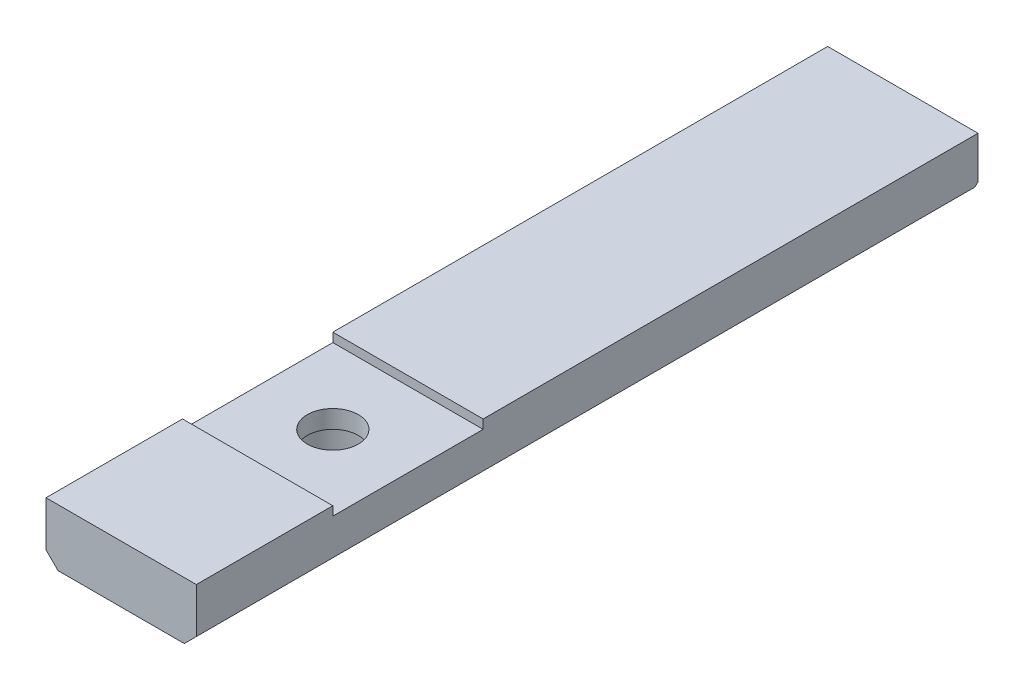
ISO-10303-21;
HEADER;
FILE_DESCRIPTION(('STEP AP214'),'2;1');
FILE_NAME('part.step','',(''),(''),'','','');
FILE_SCHEMA(('AUTOMOTIVE_DESIGN { 1 0 10303 214 1 1 1 1 }'));
ENDSEC;
DATA;
#1=APPLICATION_CONTEXT('core data for automotive mechanical design processes');
#2=APPLICATION_PROTOCOL_DEFINITION('international standard','automotive_design',2000,#1);
#3=PRODUCT_CONTEXT('',#1,'mechanical');
#4=PRODUCT('Part','Part','',(#3));
#5=PRODUCT_RELATED_PRODUCT_CATEGORY('part','',(#4));
#6=PRODUCT_DEFINITION_FORMATION('','',#4);
#7=PRODUCT_DEFINITION_CONTEXT('part definition',#1,'design');
#8=PRODUCT_DEFINITION('design','',#6,#7);
#9=PRODUCT_DEFINITION_SHAPE('','',#8);
#10=(LENGTH_UNIT() NAMED_UNIT(*) SI_UNIT(.MILLI.,.METRE.));
#11=(NAMED_UNIT(*) PLANE_ANGLE_UNIT() SI_UNIT($,.RADIAN.));
#12=(NAMED_UNIT(*) SI_UNIT($,.STERADIAN.) SOLID_ANGLE_UNIT());
#13=UNCERTAINTY_MEASURE_WITH_UNIT(LENGTH_MEASURE(1.E-05),#10,'distance_accuracy_value','');
#14=(GEOMETRIC_REPRESENTATION_CONTEXT(3) GLOBAL_UNCERTAINTY_ASSIGNED_CONTEXT((#13)) GLOBAL_UNIT_ASSIGNED_CONTEXT((#10,
#11,#12)) REPRESENTATION_CONTEXT('',''));
#15=CARTESIAN_POINT('',(0.,0.,0.));
#16=DIRECTION('',(0.,0.,1.));
#17=DIRECTION('',(1.,0.,0.));
#18=AXIS2_PLACEMENT_3D('',#15,#16,#17);
#19=CARTESIAN_POINT('',(-6.1,0.,130.));
#20=DIRECTION('',(-1.,0.,0.));
#21=DIRECTION('',(0.,0.,1.));
#22=AXIS2_PLACEMENT_3D('',#19,#20,#21);
#23=PLANE('',#22);
#24=DIRECTION('',(0.,0.,-1.));
#25=VECTOR('',#24,1.);
#26=CARTESIAN_POINT('',(-6.1,1.5,130.));
#27=LINE('',#26,#25);
#28=CARTESIAN_POINT('',(-6.1,1.5,91.3663430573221));
#29=VERTEX_POINT('',#28);
#30=CARTESIAN_POINT('',(-6.1,1.5,3.));
#31=VERTEX_POINT('',#30);
#32=EDGE_CURVE('E363',#29,#31,#27,.T.);
#33=ORIENTED_EDGE('',*,*,#32,.F.);
#34=DIRECTION('',(0.,-1.,0.));
#35=VECTOR('',#34,1.);
#36=CARTESIAN_POINT('',(-6.1,7.,91.3663430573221));
#37=LINE('',#36,#35);
#38=CARTESIAN_POINT('',(-6.1,0.500000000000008,91.3663430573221));
#39=VERTEX_POINT('',#38);
#40=EDGE_CURVE('E376',#29,#39,#37,.T.);
#41=ORIENTED_EDGE('',*,*,#40,.T.);
#42=DIRECTION('',(0.,0.,-1.));
#43=VECTOR('',#42,1.);
#44=CARTESIAN_POINT('',(-6.1,0.500000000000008,130.));
#45=LINE('',#44,#43);
#46=CARTESIAN_POINT('',(-6.1,0.500000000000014,3.99999999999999));
#47=VERTEX_POINT('',#46);
#48=EDGE_CURVE('E366',#39,#47,#45,.T.);
#49=ORIENTED_EDGE('',*,*,#48,.T.);
#50=DIRECTION('',(0.,0.707106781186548,-0.707106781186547));
#51=VECTOR('',#50,1.);
#52=CARTESIAN_POINT('',(-6.1,-62.75,67.25));
#53=LINE('',#52,#51);
#54=EDGE_CURVE('E296',#47,#31,#53,.T.);
#55=ORIENTED_EDGE('',*,*,#54,.T.);
#56=EDGE_LOOP('',(#33,#41,#49,#55));
#57=FACE_BOUND('',#56,.T.);
#58=ADVANCED_FACE('F40',(#57),#23,.F.);
#59=CARTESIAN_POINT('',(-6.1,1.5,130.));
#60=DIRECTION('',(0.,1.,0.));
#61=DIRECTION('',(-1.,0.,0.));
#62=AXIS2_PLACEMENT_3D('',#59,#60,#61);
#63=PLANE('',#62);
#64=CARTESIAN_POINT('',(-6.1,1.5,129.5));
#65=VERTEX_POINT('',#64);
#66=CARTESIAN_POINT('',(-6.1,1.5,98.2336569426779));
#67=VERTEX_POINT('',#66);
#68=EDGE_CURVE('E364',#65,#67,#27,.T.);
#69=ORIENTED_EDGE('',*,*,#68,.T.);
#70=CARTESIAN_POINT('',(0.,1.5,94.8));
#71=DIRECTION('',(0.,1.,0.));
#72=DIRECTION('',(-1.,0.,0.));
#73=AXIS2_PLACEMENT_3D('',#70,#71,#72);
#74=CIRCLE('',#73,7.00000000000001);
#75=CARTESIAN_POINT('',(6.1,1.5,98.2336569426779));
#76=VERTEX_POINT('',#75);
#77=EDGE_CURVE('E400',#67,#76,#74,.T.);
#78=ORIENTED_EDGE('',*,*,#77,.T.);
#79=DIRECTION('',(0.,0.,-1.));
#80=VECTOR('',#79,1.);
#81=CARTESIAN_POINT('',(6.1,1.5,130.));
#82=LINE('',#81,#80);
#83=CARTESIAN_POINT('',(6.1,1.5,129.5));
#84=VERTEX_POINT('',#83);
#85=EDGE_CURVE('E360',#84,#76,#82,.T.);
#86=ORIENTED_EDGE('',*,*,#85,.F.);
#87=DIRECTION('',(-1.,0.,0.));
#88=VECTOR('',#87,1.);
#89=CARTESIAN_POINT('',(-6.1,1.5,129.5));
#90=LINE('',#89,#88);
#91=EDGE_CURVE('E303',#84,#65,#90,.T.);
#92=ORIENTED_EDGE('',*,*,#91,.T.);
#93=EDGE_LOOP('',(#69,#78,#86,#92));
#94=FACE_BOUND('',#93,.T.);
#95=ADVANCED_FACE('F398',(#94),#63,.F.);
#96=CARTESIAN_POINT('',(6.1,1.5,130.));
#97=DIRECTION('',(1.,0.,0.));
#98=DIRECTION('',(0.,0.,-1.));
#99=AXIS2_PLACEMENT_3D('',#96,#97,#98);
#100=PLANE('',#99);
#101=ORIENTED_EDGE('',*,*,#85,.T.);
#102=DIRECTION('',(0.,-1.,0.));
#103=VECTOR('',#102,1.);
#104=CARTESIAN_POINT('',(6.1,7.,98.2336569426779));
#105=LINE('',#104,#103);
#106=CARTESIAN_POINT('',(6.1,0.500000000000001,98.2336569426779));
#107=VERTEX_POINT('',#106);
#108=EDGE_CURVE('E407',#76,#107,#105,.T.);
#109=ORIENTED_EDGE('',*,*,#108,.T.);
#110=DIRECTION('',(0.,0.,1.));
#111=VECTOR('',#110,1.);
#112=CARTESIAN_POINT('',(6.1,0.500000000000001,130.));
#113=LINE('',#112,#111);
#114=CARTESIAN_POINT('',(6.1,0.500000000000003,128.5));
#115=VERTEX_POINT('',#114);
#116=EDGE_CURVE('E232',#107,#115,#113,.T.);
#117=ORIENTED_EDGE('',*,*,#116,.T.);
#118=DIRECTION('',(0.,0.707106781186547,0.707106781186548));
#119=VECTOR('',#118,1.);
#120=CARTESIAN_POINT('',(6.1,1.75,129.75));
#121=LINE('',#120,#119);
#122=EDGE_CURVE('E300',#115,#84,#121,.T.);
#123=ORIENTED_EDGE('',*,*,#122,.T.);
#124=EDGE_LOOP('',(#101,#109,#117,#123));
#125=FACE_BOUND('',#124,.T.);
#126=ADVANCED_FACE('F404',(#125),#100,.F.);
#127=CARTESIAN_POINT('',(-6.1,0.500000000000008,130.));
#128=DIRECTION('',(-0.707106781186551,0.707106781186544,0.));
#129=DIRECTION('',(-0.707106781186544,-0.707106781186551,0.));
#130=AXIS2_PLACEMENT_3D('',#127,#128,#129);
#131=PLANE('',#130);
#132=CARTESIAN_POINT('',(0.,6.60000000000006,94.8));
#133=DIRECTION('',(-0.707106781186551,0.707106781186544,0.));
#134=DIRECTION('',(-0.707106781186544,-0.707106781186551,0.));
#135=AXIS2_PLACEMENT_3D('',#132,#133,#134);
#136=ELLIPSE('',#135,9.89949493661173,7.00000000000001);
#137=CARTESIAN_POINT('',(-6.6,0.,92.4676192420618));
#138=VERTEX_POINT('',#137);
#139=EDGE_CURVE('E382',#138,#39,#136,.F.);
#140=ORIENTED_EDGE('',*,*,#139,.F.);
#141=DIRECTION('',(0.,0.,1.));
#142=VECTOR('',#141,1.);
#143=CARTESIAN_POINT('',(-6.6,0.,130.));
#144=LINE('',#143,#142);
#145=CARTESIAN_POINT('',(-6.6,0.,4.49999999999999));
#146=VERTEX_POINT('',#145);
#147=EDGE_CURVE('E230',#146,#138,#144,.T.);
#148=ORIENTED_EDGE('',*,*,#147,.F.);
#149=DIRECTION('',(0.577350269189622,0.577350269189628,-0.577350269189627));
#150=VECTOR('',#149,1.);
#151=CARTESIAN_POINT('',(-48.0999999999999,-41.5000000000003,46.0000000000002));
#152=LINE('',#151,#150);
#153=EDGE_CURVE('E275',#47,#146,#152,.F.);
#154=ORIENTED_EDGE('',*,*,#153,.F.);
#155=ORIENTED_EDGE('',*,*,#48,.F.);
#156=EDGE_LOOP('',(#140,#148,#154,#155));
#157=FACE_BOUND('',#156,.T.);
#158=ADVANCED_FACE('F381',(#157),#131,.F.);
#159=CARTESIAN_POINT('',(6.60000000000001,0.,130.));
#160=DIRECTION('',(0.707106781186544,0.707106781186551,0.));
#161=DIRECTION('',(-0.707106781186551,0.707106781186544,0.));
#162=AXIS2_PLACEMENT_3D('',#159,#160,#161);
#163=PLANE('',#162);
#164=CARTESIAN_POINT('',(0.,6.59999999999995,94.8));
#165=DIRECTION('',(0.707106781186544,0.707106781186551,0.));
#166=DIRECTION('',(0.707106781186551,-0.707106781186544,0.));
#167=AXIS2_PLACEMENT_3D('',#164,#165,#166);
#168=ELLIPSE('',#167,9.89949493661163,7.00000000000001);
#169=CARTESIAN_POINT('',(6.60000000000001,0.,97.1323807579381));
#170=VERTEX_POINT('',#169);
#171=EDGE_CURVE('E213',#170,#107,#168,.F.);
#172=ORIENTED_EDGE('',*,*,#171,.F.);
#173=DIRECTION('',(0.,0.,-1.));
#174=VECTOR('',#173,1.);
#175=CARTESIAN_POINT('',(6.60000000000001,0.,130.));
#176=LINE('',#175,#174);
#177=CARTESIAN_POINT('',(6.6,0.,128.));
#178=VERTEX_POINT('',#177);
#179=EDGE_CURVE('E224',#178,#170,#176,.T.);
#180=ORIENTED_EDGE('',*,*,#179,.F.);
#181=DIRECTION('',(-0.57735026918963,0.577350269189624,0.577350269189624));
#182=VECTOR('',#181,1.);
#183=CARTESIAN_POINT('',(5.93333333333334,0.666666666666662,128.666666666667));
#184=LINE('',#183,#182);
#185=EDGE_CURVE('E214',#115,#178,#184,.F.);
#186=ORIENTED_EDGE('',*,*,#185,.F.);
#187=ORIENTED_EDGE('',*,*,#116,.F.);
#188=EDGE_LOOP('',(#172,#180,#186,#187));
#189=FACE_BOUND('',#188,.T.);
#190=ADVANCED_FACE('F409',(#189),#163,.F.);
#191=CARTESIAN_POINT('',(0.,0.,94.8));
#192=DIRECTION('',(0.,1.,0.));
#193=DIRECTION('',(0.,0.,1.));
#194=AXIS2_PLACEMENT_3D('',#191,#192,#193);
#195=CYLINDRICAL_SURFACE('',#194,4.25000000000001);
#196=CARTESIAN_POINT('',(0.,10.,94.8));
#197=DIRECTION('',(0.,1.,0.));
#198=DIRECTION('',(0.,0.,1.));
#199=AXIS2_PLACEMENT_3D('',#196,#197,#198);
#200=CIRCLE('',#199,4.25000000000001);
#201=CARTESIAN_POINT('',(0.,10.,99.05));
#202=VERTEX_POINT('',#201);
#203=EDGE_CURVE('E423',#202,#202,#200,.T.);
#204=ORIENTED_EDGE('',*,*,#203,.T.);
#205=EDGE_LOOP('',(#204));
#206=FACE_BOUND('',#205,.T.);
#207=CARTESIAN_POINT('',(0.,7.,94.8));
#208=DIRECTION('',(0.,-1.,0.));
#209=DIRECTION('',(0.,0.,-1.));
#210=AXIS2_PLACEMENT_3D('',#207,#208,#209);
#211=CIRCLE('',#210,4.25000000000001);
#212=CARTESIAN_POINT('',(0.,7.,90.55));
#213=VERTEX_POINT('',#212);
#214=EDGE_CURVE('E225',#213,#213,#211,.F.);
#215=ORIENTED_EDGE('',*,*,#214,.F.);
#216=EDGE_LOOP('',(#215));
#217=FACE_BOUND('',#216,.T.);
#218=ADVANCED_FACE('F483',(#206,#217),#195,.F.);
#219=CARTESIAN_POINT('',(-12.5,11.5,130.));
#220=DIRECTION('',(0.,-1.,0.));
#221=DIRECTION('',(1.,0.,0.));
#222=AXIS2_PLACEMENT_3D('',#219,#220,#221);
#223=PLANE('',#222);
#224=DIRECTION('',(0.,0.,-1.));
#225=VECTOR('',#224,1.);
#226=CARTESIAN_POINT('',(12.5,11.5,130.));
#227=LINE('',#226,#225);
#228=CARTESIAN_POINT('',(12.5,11.5,130.));
#229=VERTEX_POINT('',#228);
#230=CARTESIAN_POINT('',(12.5,11.5,107.3));
#231=VERTEX_POINT('',#230);
#232=EDGE_CURVE('E356',#229,#231,#227,.T.);
#233=ORIENTED_EDGE('',*,*,#232,.T.);
#234=DIRECTION('',(1.,0.,0.));
#235=VECTOR('',#234,1.);
#236=CARTESIAN_POINT('',(-12.5,11.5,107.3));
#237=LINE('',#236,#235);
#238=CARTESIAN_POINT('',(-12.5,11.5,107.3));
#239=VERTEX_POINT('',#238);
#240=EDGE_CURVE('E329',#239,#231,#237,.T.);
#241=ORIENTED_EDGE('',*,*,#240,.F.);
#242=DIRECTION('',(0.,0.,-1.));
#243=VECTOR('',#242,1.);
#244=CARTESIAN_POINT('',(-12.5,11.5,130.));
#245=LINE('',#244,#243);
#246=CARTESIAN_POINT('',(-12.5,11.5,130.));
#247=VERTEX_POINT('',#246);
#248=EDGE_CURVE('E352',#247,#239,#245,.T.);
#249=ORIENTED_EDGE('',*,*,#248,.F.);
#250=DIRECTION('',(-1.,0.,0.));
#251=VECTOR('',#250,1.);
#252=CARTESIAN_POINT('',(-12.5,11.5,130.));
#253=LINE('',#252,#251);
#254=EDGE_CURVE('E343',#229,#247,#253,.T.);
#255=ORIENTED_EDGE('',*,*,#254,.F.);
#256=EDGE_LOOP('',(#233,#241,#249,#255));
#257=FACE_BOUND('',#256,.T.);
#258=ADVANCED_FACE('F468',(#257),#223,.F.);
#259=CARTESIAN_POINT('',(-12.5,0.,130.));
#260=DIRECTION('',(1.,0.,0.));
#261=DIRECTION('',(0.,1.,0.));
#262=AXIS2_PLACEMENT_3D('',#259,#260,#261);
#263=PLANE('',#262);
#264=DIRECTION('',(0.,-0.707106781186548,0.707106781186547));
#265=VECTOR('',#264,1.);
#266=CARTESIAN_POINT('',(-12.5,4.5,0.));
#267=LINE('',#266,#265);
#268=CARTESIAN_POINT('',(-12.5,4.5,0.));
#269=VERTEX_POINT('',#268);
#270=CARTESIAN_POINT('',(-12.5,4.,0.499999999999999));
#271=VERTEX_POINT('',#270);
#272=EDGE_CURVE('E288',#269,#271,#267,.T.);
#273=ORIENTED_EDGE('',*,*,#272,.T.);
#274=DIRECTION('',(0.,0.,1.));
#275=VECTOR('',#274,1.);
#276=CARTESIAN_POINT('',(-12.5,4.,130.));
#277=LINE('',#276,#275);
#278=CARTESIAN_POINT('',(-12.5,4.,130.));
#279=VERTEX_POINT('',#278);
#280=EDGE_CURVE('E11',#271,#279,#277,.T.);
#281=ORIENTED_EDGE('',*,*,#280,.T.);
#282=DIRECTION('',(0.,-1.,0.));
#283=VECTOR('',#282,1.);
#284=CARTESIAN_POINT('',(-12.5,0.,130.));
#285=LINE('',#284,#283);
#286=EDGE_CURVE('E338',#247,#279,#285,.T.);
#287=ORIENTED_EDGE('',*,*,#286,.F.);
#288=ORIENTED_EDGE('',*,*,#248,.T.);
#289=DIRECTION('',(0.,-1.,0.));
#290=VECTOR('',#289,1.);
#291=CARTESIAN_POINT('',(-12.5,11.5,107.3));
#292=LINE('',#291,#290);
#293=CARTESIAN_POINT('',(-12.5,10.,107.3));
#294=VERTEX_POINT('',#293);
#295=EDGE_CURVE('E312',#239,#294,#292,.T.);
#296=ORIENTED_EDGE('',*,*,#295,.T.);
#297=DIRECTION('',(0.,0.,-1.));
#298=VECTOR('',#297,1.);
#299=CARTESIAN_POINT('',(-12.5,10.,107.3));
#300=LINE('',#299,#298);
#301=CARTESIAN_POINT('',(-12.5,10.,82.3));
#302=VERTEX_POINT('',#301);
#303=EDGE_CURVE('E315',#294,#302,#300,.T.);
#304=ORIENTED_EDGE('',*,*,#303,.T.);
#305=DIRECTION('',(0.,1.,0.));
#306=VECTOR('',#305,1.);
#307=CARTESIAN_POINT('',(-12.5,10.,82.3));
#308=LINE('',#307,#306);
#309=CARTESIAN_POINT('',(-12.5,11.5,82.3));
#310=VERTEX_POINT('',#309);
#311=EDGE_CURVE('E319',#302,#310,#308,.T.);
#312=ORIENTED_EDGE('',*,*,#311,.T.);
#313=CARTESIAN_POINT('',(-12.5,11.5,0.));
#314=VERTEX_POINT('',#313);
#315=EDGE_CURVE('E345',#310,#314,#245,.T.);
#316=ORIENTED_EDGE('',*,*,#315,.T.);
#317=DIRECTION('',(0.,-1.,0.));
#318=VECTOR('',#317,1.);
#319=CARTESIAN_POINT('',(-12.5,0.,0.));
#320=LINE('',#319,#318);
#321=EDGE_CURVE('E331',#314,#269,#320,.T.);
#322=ORIENTED_EDGE('',*,*,#321,.T.);
#323=EDGE_LOOP('',(#273,#281,#287,#288,#296,#304,#312,#316,#322));
#324=FACE_BOUND('',#323,.T.);
#325=ADVANCED_FACE('F464',(#324),#263,.F.);
#326=CARTESIAN_POINT('',(-12.5,0.,130.));
#327=DIRECTION('',(0.,1.,0.));
#328=DIRECTION('',(0.,0.,1.));
#329=AXIS2_PLACEMENT_3D('',#326,#327,#328);
#330=PLANE('',#329);
#331=DIRECTION('',(1.,0.,0.));
#332=VECTOR('',#331,1.);
#333=CARTESIAN_POINT('',(-12.5,0.,128.));
#334=LINE('',#333,#332);
#335=CARTESIAN_POINT('',(-8.5,0.,128.));
#336=VERTEX_POINT('',#335);
#337=CARTESIAN_POINT('',(-6.6,0.,128.));
#338=VERTEX_POINT('',#337);
#339=EDGE_CURVE('E268',#336,#338,#334,.T.);
#340=ORIENTED_EDGE('',*,*,#339,.F.);
#341=DIRECTION('',(0.,0.,-1.));
#342=VECTOR('',#341,1.);
#343=CARTESIAN_POINT('',(-8.5,0.,130.));
#344=LINE('',#343,#342);
#345=CARTESIAN_POINT('',(-8.5,0.,4.5));
#346=VERTEX_POINT('',#345);
#347=EDGE_CURVE('E48',#336,#346,#344,.T.);
#348=ORIENTED_EDGE('',*,*,#347,.T.);
#349=DIRECTION('',(1.,0.,0.));
#350=VECTOR('',#349,1.);
#351=CARTESIAN_POINT('',(-12.5,0.,4.5));
#352=LINE('',#351,#350);
#353=EDGE_CURVE('E265',#346,#146,#352,.T.);
#354=ORIENTED_EDGE('',*,*,#353,.T.);
#355=ORIENTED_EDGE('',*,*,#147,.T.);
#356=CARTESIAN_POINT('',(0.,0.,94.8));
#357=DIRECTION('',(0.,1.,0.));
#358=DIRECTION('',(0.,0.,1.));
#359=AXIS2_PLACEMENT_3D('',#356,#357,#358);
#360=CIRCLE('',#359,7.00000000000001);
#361=CARTESIAN_POINT('',(-6.6,0.,97.1323807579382));
#362=VERTEX_POINT('',#361);
#363=EDGE_CURVE('E384',#138,#362,#360,.T.);
#364=ORIENTED_EDGE('',*,*,#363,.T.);
#365=EDGE_CURVE('E234',#362,#338,#144,.T.);
#366=ORIENTED_EDGE('',*,*,#365,.T.);
#367=EDGE_LOOP('',(#340,#348,#354,#355,#364,#366));
#368=FACE_BOUND('',#367,.T.);
#369=ADVANCED_FACE('F264',(#368),#330,.F.);
#370=CARTESIAN_POINT('',(-6.1,0.500000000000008,128.5));
#371=VERTEX_POINT('',#370);
#372=CARTESIAN_POINT('',(-6.1,0.500000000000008,98.2336569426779));
#373=VERTEX_POINT('',#372);
#374=EDGE_CURVE('E367',#371,#373,#45,.T.);
#375=ORIENTED_EDGE('',*,*,#374,.T.);
#376=DIRECTION('',(0.,-1.,0.));
#377=VECTOR('',#376,1.);
#378=CARTESIAN_POINT('',(-6.1,7.,98.2336569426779));
#379=LINE('',#378,#377);
#380=EDGE_CURVE('E388',#373,#67,#379,.F.);
#381=ORIENTED_EDGE('',*,*,#380,.T.);
#382=ORIENTED_EDGE('',*,*,#68,.F.);
#383=DIRECTION('',(0.,-0.707106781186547,-0.707106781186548));
#384=VECTOR('',#383,1.);
#385=CARTESIAN_POINT('',(-6.1,1.,129.));
#386=LINE('',#385,#384);
#387=EDGE_CURVE('E306',#65,#371,#386,.T.);
#388=ORIENTED_EDGE('',*,*,#387,.T.);
#389=EDGE_LOOP('',(#375,#381,#382,#388));
#390=FACE_BOUND('',#389,.T.);
#391=ADVANCED_FACE('F395',(#390),#23,.F.);
#392=CARTESIAN_POINT('',(6.1,1.5,91.3663430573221));
#393=VERTEX_POINT('',#392);
#394=CARTESIAN_POINT('',(6.1,1.5,3.));
#395=VERTEX_POINT('',#394);
#396=EDGE_CURVE('E359',#393,#395,#82,.T.);
#397=ORIENTED_EDGE('',*,*,#396,.F.);
#398=EDGE_CURVE('E431',#393,#29,#74,.T.);
#399=ORIENTED_EDGE('',*,*,#398,.T.);
#400=ORIENTED_EDGE('',*,*,#32,.T.);
#401=DIRECTION('',(1.,0.,0.));
#402=VECTOR('',#401,1.);
#403=CARTESIAN_POINT('',(-6.10000000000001,1.5,3.));
#404=LINE('',#403,#402);
#405=EDGE_CURVE('E292',#31,#395,#404,.T.);
#406=ORIENTED_EDGE('',*,*,#405,.T.);
#407=EDGE_LOOP('',(#397,#399,#400,#406));
#408=FACE_BOUND('',#407,.T.);
#409=ADVANCED_FACE('F455',(#408),#63,.F.);
#410=CARTESIAN_POINT('',(6.09999999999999,0.500000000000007,3.99999999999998));
#411=VERTEX_POINT('',#410);
#412=CARTESIAN_POINT('',(6.1,0.500000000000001,91.3663430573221));
#413=VERTEX_POINT('',#412);
#414=EDGE_CURVE('E238',#411,#413,#113,.T.);
#415=ORIENTED_EDGE('',*,*,#414,.T.);
#416=DIRECTION('',(0.,-1.,0.));
#417=VECTOR('',#416,1.);
#418=CARTESIAN_POINT('',(6.1,7.,91.3663430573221));
#419=LINE('',#418,#417);
#420=EDGE_CURVE('E208',#413,#393,#419,.F.);
#421=ORIENTED_EDGE('',*,*,#420,.T.);
#422=ORIENTED_EDGE('',*,*,#396,.T.);
#423=DIRECTION('',(0.,-0.707106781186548,0.707106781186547));
#424=VECTOR('',#423,1.);
#425=CARTESIAN_POINT('',(6.1,-62.,66.5));
#426=LINE('',#425,#424);
#427=EDGE_CURVE('E289',#395,#411,#426,.T.);
#428=ORIENTED_EDGE('',*,*,#427,.T.);
#429=EDGE_LOOP('',(#415,#421,#422,#428));
#430=FACE_BOUND('',#429,.T.);
#431=ADVANCED_FACE('F462',(#430),#100,.F.);
#432=CARTESIAN_POINT('',(6.1,0.,130.));
#433=DIRECTION('',(0.,1.,0.));
#434=DIRECTION('',(-1.,0.,0.));
#435=AXIS2_PLACEMENT_3D('',#432,#433,#434);
#436=PLANE('',#435);
#437=CARTESIAN_POINT('',(6.60000000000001,0.,4.49999999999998));
#438=VERTEX_POINT('',#437);
#439=CARTESIAN_POINT('',(8.49999999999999,0.,4.5));
#440=VERTEX_POINT('',#439);
#441=EDGE_CURVE('E278',#438,#440,#352,.T.);
#442=ORIENTED_EDGE('',*,*,#441,.T.);
#443=DIRECTION('',(0.,0.,1.));
#444=VECTOR('',#443,1.);
#445=CARTESIAN_POINT('',(8.49999999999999,0.,130.));
#446=LINE('',#445,#444);
#447=CARTESIAN_POINT('',(8.49999999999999,0.,128.));
#448=VERTEX_POINT('',#447);
#449=EDGE_CURVE('E252',#440,#448,#446,.T.);
#450=ORIENTED_EDGE('',*,*,#449,.T.);
#451=EDGE_CURVE('E277',#178,#448,#334,.T.);
#452=ORIENTED_EDGE('',*,*,#451,.F.);
#453=ORIENTED_EDGE('',*,*,#179,.T.);
#454=CARTESIAN_POINT('',(0.,0.,94.8));
#455=DIRECTION('',(0.,1.,0.));
#456=DIRECTION('',(-1.,0.,0.));
#457=AXIS2_PLACEMENT_3D('',#454,#455,#456);
#458=CIRCLE('',#457,7.00000000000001);
#459=CARTESIAN_POINT('',(6.60000000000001,0.,92.4676192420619));
#460=VERTEX_POINT('',#459);
#461=EDGE_CURVE('E205',#170,#460,#458,.T.);
#462=ORIENTED_EDGE('',*,*,#461,.T.);
#463=EDGE_CURVE('E220',#460,#438,#176,.T.);
#464=ORIENTED_EDGE('',*,*,#463,.T.);
#465=EDGE_LOOP('',(#442,#450,#452,#453,#462,#464));
#466=FACE_BOUND('',#465,.T.);
#467=ADVANCED_FACE('F219',(#466),#436,.F.);
#468=CARTESIAN_POINT('',(12.5,11.5,130.));
#469=DIRECTION('',(-1.,0.,0.));
#470=DIRECTION('',(0.,-1.,0.));
#471=AXIS2_PLACEMENT_3D('',#468,#469,#470);
#472=PLANE('',#471);
#473=DIRECTION('',(0.,1.,0.));
#474=VECTOR('',#473,1.);
#475=CARTESIAN_POINT('',(12.5,11.5,130.));
#476=LINE('',#475,#474);
#477=CARTESIAN_POINT('',(12.5,3.99999999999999,130.));
#478=VERTEX_POINT('',#477);
#479=EDGE_CURVE('E340',#478,#229,#476,.T.);
#480=ORIENTED_EDGE('',*,*,#479,.F.);
#481=DIRECTION('',(0.,0.,-1.));
#482=VECTOR('',#481,1.);
#483=CARTESIAN_POINT('',(12.5,3.99999999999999,130.));
#484=LINE('',#483,#482);
#485=CARTESIAN_POINT('',(12.5,3.99999999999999,0.500000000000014));
#486=VERTEX_POINT('',#485);
#487=EDGE_CURVE('E245',#478,#486,#484,.T.);
#488=ORIENTED_EDGE('',*,*,#487,.T.);
#489=DIRECTION('',(0.,-0.707106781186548,0.707106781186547));
#490=VECTOR('',#489,1.);
#491=CARTESIAN_POINT('',(12.5,4.5,0.));
#492=LINE('',#491,#490);
#493=CARTESIAN_POINT('',(12.5,4.5,0.));
#494=VERTEX_POINT('',#493);
#495=EDGE_CURVE('E285',#494,#486,#492,.T.);
#496=ORIENTED_EDGE('',*,*,#495,.F.);
#497=DIRECTION('',(0.,1.,0.));
#498=VECTOR('',#497,1.);
#499=CARTESIAN_POINT('',(12.5,11.5,0.));
#500=LINE('',#499,#498);
#501=CARTESIAN_POINT('',(12.5,11.5,0.));
#502=VERTEX_POINT('',#501);
#503=EDGE_CURVE('E348',#494,#502,#500,.T.);
#504=ORIENTED_EDGE('',*,*,#503,.T.);
#505=CARTESIAN_POINT('',(12.5,11.5,82.3));
#506=VERTEX_POINT('',#505);
#507=EDGE_CURVE('E355',#506,#502,#227,.T.);
#508=ORIENTED_EDGE('',*,*,#507,.F.);
#509=DIRECTION('',(0.,1.,0.));
#510=VECTOR('',#509,1.);
#511=CARTESIAN_POINT('',(12.5,10.,82.3));
#512=LINE('',#511,#510);
#513=CARTESIAN_POINT('',(12.5,10.,82.3));
#514=VERTEX_POINT('',#513);
#515=EDGE_CURVE('E316',#514,#506,#512,.T.);
#516=ORIENTED_EDGE('',*,*,#515,.F.);
#517=DIRECTION('',(0.,0.,-1.));
#518=VECTOR('',#517,1.);
#519=CARTESIAN_POINT('',(12.5,10.,107.3));
#520=LINE('',#519,#518);
#521=CARTESIAN_POINT('',(12.5,10.,107.3));
#522=VERTEX_POINT('',#521);
#523=EDGE_CURVE('E325',#522,#514,#520,.T.);
#524=ORIENTED_EDGE('',*,*,#523,.F.);
#525=DIRECTION('',(0.,-1.,0.));
#526=VECTOR('',#525,1.);
#527=CARTESIAN_POINT('',(12.5,11.5,107.3));
#528=LINE('',#527,#526);
#529=EDGE_CURVE('E311',#231,#522,#528,.T.);
#530=ORIENTED_EDGE('',*,*,#529,.F.);
#531=ORIENTED_EDGE('',*,*,#232,.F.);
#532=EDGE_LOOP('',(#480,#488,#496,#504,#508,#516,#524,#530,#531));
#533=FACE_BOUND('',#532,.T.);
#534=ADVANCED_FACE('F500',(#533),#472,.F.);
#535=ORIENTED_EDGE('',*,*,#315,.F.);
#536=DIRECTION('',(1.,0.,0.));
#537=VECTOR('',#536,1.);
#538=CARTESIAN_POINT('',(-12.5,11.5,82.3));
#539=LINE('',#538,#537);
#540=EDGE_CURVE('E332',#310,#506,#539,.T.);
#541=ORIENTED_EDGE('',*,*,#540,.T.);
#542=ORIENTED_EDGE('',*,*,#507,.T.);
#543=DIRECTION('',(-1.,0.,0.));
#544=VECTOR('',#543,1.);
#545=CARTESIAN_POINT('',(-12.5,11.5,0.));
#546=LINE('',#545,#544);
#547=EDGE_CURVE('E341',#502,#314,#546,.T.);
#548=ORIENTED_EDGE('',*,*,#547,.T.);
#549=EDGE_LOOP('',(#535,#541,#542,#548));
#550=FACE_BOUND('',#549,.T.);
#551=ADVANCED_FACE('F505',(#550),#223,.F.);
#552=CARTESIAN_POINT('',(-12.5,0.,130.));
#553=DIRECTION('',(0.,0.,-1.));
#554=DIRECTION('',(-1.,0.,0.));
#555=AXIS2_PLACEMENT_3D('',#552,#553,#554);
#556=PLANE('',#555);
#557=DIRECTION('',(1.,0.,0.));
#558=VECTOR('',#557,1.);
#559=CARTESIAN_POINT('',(-12.5,2.,130.));
#560=LINE('',#559,#558);
#561=CARTESIAN_POINT('',(-10.5,2.,130.));
#562=VERTEX_POINT('',#561);
#563=CARTESIAN_POINT('',(10.5,2.,130.));
#564=VERTEX_POINT('',#563);
#565=EDGE_CURVE('E293',#562,#564,#560,.T.);
#566=ORIENTED_EDGE('',*,*,#565,.T.);
#567=DIRECTION('',(-0.70710678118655,-0.707106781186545,0.));
#568=VECTOR('',#567,1.);
#569=CARTESIAN_POINT('',(12.5,3.99999999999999,130.));
#570=LINE('',#569,#568);
#571=EDGE_CURVE('E259',#564,#478,#570,.F.);
#572=ORIENTED_EDGE('',*,*,#571,.T.);
#573=ORIENTED_EDGE('',*,*,#479,.T.);
#574=ORIENTED_EDGE('',*,*,#254,.T.);
#575=ORIENTED_EDGE('',*,*,#286,.T.);
#576=DIRECTION('',(-0.707106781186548,0.707106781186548,0.));
#577=VECTOR('',#576,1.);
#578=CARTESIAN_POINT('',(-8.5,0.,130.));
#579=LINE('',#578,#577);
#580=EDGE_CURVE('E257',#279,#562,#579,.F.);
#581=ORIENTED_EDGE('',*,*,#580,.T.);
#582=EDGE_LOOP('',(#566,#572,#573,#574,#575,#581));
#583=FACE_BOUND('',#582,.T.);
#584=ADVANCED_FACE('F418',(#583),#556,.F.);
#585=CARTESIAN_POINT('',(-12.5,0.,0.));
#586=DIRECTION('',(0.,0.,-1.));
#587=DIRECTION('',(-1.,0.,0.));
#588=AXIS2_PLACEMENT_3D('',#585,#586,#587);
#589=PLANE('',#588);
#590=DIRECTION('',(1.,0.,0.));
#591=VECTOR('',#590,1.);
#592=CARTESIAN_POINT('',(-12.5,4.5,0.));
#593=LINE('',#592,#591);
#594=EDGE_CURVE('E282',#269,#494,#593,.T.);
#595=ORIENTED_EDGE('',*,*,#594,.F.);
#596=ORIENTED_EDGE('',*,*,#321,.F.);
#597=ORIENTED_EDGE('',*,*,#547,.F.);
#598=ORIENTED_EDGE('',*,*,#503,.F.);
#599=EDGE_LOOP('',(#595,#596,#597,#598));
#600=FACE_BOUND('',#599,.T.);
#601=ADVANCED_FACE('F473',(#600),#589,.T.);
#602=EDGE_CURVE('E387',#373,#362,#136,.F.);
#603=ORIENTED_EDGE('',*,*,#602,.F.);
#604=ORIENTED_EDGE('',*,*,#374,.F.);
#605=DIRECTION('',(-0.577350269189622,-0.577350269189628,-0.577350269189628));
#606=VECTOR('',#605,1.);
#607=CARTESIAN_POINT('',(-5.6,1.00000000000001,129.));
#608=LINE('',#607,#606);
#609=EDGE_CURVE('E309',#338,#371,#608,.F.);
#610=ORIENTED_EDGE('',*,*,#609,.F.);
#611=ORIENTED_EDGE('',*,*,#365,.F.);
#612=EDGE_LOOP('',(#603,#604,#610,#611));
#613=FACE_BOUND('',#612,.T.);
#614=ADVANCED_FACE('F392',(#613),#131,.F.);
#615=EDGE_CURVE('E201',#413,#460,#168,.F.);
#616=ORIENTED_EDGE('',*,*,#615,.F.);
#617=ORIENTED_EDGE('',*,*,#414,.F.);
#618=DIRECTION('',(0.57735026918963,-0.577350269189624,0.577350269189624));
#619=VECTOR('',#618,1.);
#620=CARTESIAN_POINT('',(48.4333333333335,-41.8333333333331,46.333333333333));
#621=LINE('',#620,#619);
#622=EDGE_CURVE('E229',#438,#411,#621,.F.);
#623=ORIENTED_EDGE('',*,*,#622,.F.);
#624=ORIENTED_EDGE('',*,*,#463,.F.);
#625=EDGE_LOOP('',(#616,#617,#623,#624));
#626=FACE_BOUND('',#625,.T.);
#627=ADVANCED_FACE('F228',(#626),#163,.F.);
#628=CARTESIAN_POINT('',(-12.5,11.5,107.3));
#629=DIRECTION('',(0.,0.,1.));
#630=DIRECTION('',(1.,0.,0.));
#631=AXIS2_PLACEMENT_3D('',#628,#629,#630);
#632=PLANE('',#631);
#633=ORIENTED_EDGE('',*,*,#529,.T.);
#634=DIRECTION('',(1.,0.,0.));
#635=VECTOR('',#634,1.);
#636=CARTESIAN_POINT('',(-12.5,10.,107.3));
#637=LINE('',#636,#635);
#638=EDGE_CURVE('E322',#294,#522,#637,.T.);
#639=ORIENTED_EDGE('',*,*,#638,.F.);
#640=ORIENTED_EDGE('',*,*,#295,.F.);
#641=ORIENTED_EDGE('',*,*,#240,.T.);
#642=EDGE_LOOP('',(#633,#639,#640,#641));
#643=FACE_BOUND('',#642,.T.);
#644=ADVANCED_FACE('F475',(#643),#632,.F.);
#645=CARTESIAN_POINT('',(-12.5,10.,82.3));
#646=DIRECTION('',(0.,0.,-1.));
#647=DIRECTION('',(-1.,0.,0.));
#648=AXIS2_PLACEMENT_3D('',#645,#646,#647);
#649=PLANE('',#648);
#650=ORIENTED_EDGE('',*,*,#515,.T.);
#651=ORIENTED_EDGE('',*,*,#540,.F.);
#652=ORIENTED_EDGE('',*,*,#311,.F.);
#653=DIRECTION('',(1.,0.,0.));
#654=VECTOR('',#653,1.);
#655=CARTESIAN_POINT('',(-12.5,10.,82.3));
#656=LINE('',#655,#654);
#657=EDGE_CURVE('E335',#302,#514,#656,.T.);
#658=ORIENTED_EDGE('',*,*,#657,.T.);
#659=EDGE_LOOP('',(#650,#651,#652,#658));
#660=FACE_BOUND('',#659,.T.);
#661=ADVANCED_FACE('F479',(#660),#649,.F.);
#662=CARTESIAN_POINT('',(-12.5,10.,107.3));
#663=DIRECTION('',(0.,-1.,0.));
#664=DIRECTION('',(0.,0.,-1.));
#665=AXIS2_PLACEMENT_3D('',#662,#663,#664);
#666=PLANE('',#665);
#667=ORIENTED_EDGE('',*,*,#203,.F.);
#668=EDGE_LOOP('',(#667));
#669=FACE_BOUND('',#668,.T.);
#670=ORIENTED_EDGE('',*,*,#523,.T.);
#671=ORIENTED_EDGE('',*,*,#657,.F.);
#672=ORIENTED_EDGE('',*,*,#303,.F.);
#673=ORIENTED_EDGE('',*,*,#638,.T.);
#674=EDGE_LOOP('',(#670,#671,#672,#673));
#675=FACE_BOUND('',#674,.T.);
#676=ADVANCED_FACE('F517',(#669,#675),#666,.F.);
#677=CARTESIAN_POINT('',(-12.5,4.5,0.));
#678=DIRECTION('',(0.,0.707106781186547,0.707106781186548));
#679=DIRECTION('',(0.,-0.707106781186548,0.707106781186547));
#680=AXIS2_PLACEMENT_3D('',#677,#678,#679);
#681=PLANE('',#680);
#682=ORIENTED_EDGE('',*,*,#495,.T.);
#683=DIRECTION('',(0.577350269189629,0.577350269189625,-0.577350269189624));
#684=VECTOR('',#683,1.);
#685=CARTESIAN_POINT('',(-30.6666666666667,-39.1666666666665,43.6666666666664));
#686=LINE('',#685,#684);
#687=EDGE_CURVE('E250',#486,#440,#686,.F.);
#688=ORIENTED_EDGE('',*,*,#687,.T.);
#689=ORIENTED_EDGE('',*,*,#441,.F.);
#690=ORIENTED_EDGE('',*,*,#622,.T.);
#691=ORIENTED_EDGE('',*,*,#427,.F.);
#692=ORIENTED_EDGE('',*,*,#405,.F.);
#693=ORIENTED_EDGE('',*,*,#54,.F.);
#694=ORIENTED_EDGE('',*,*,#153,.T.);
#695=ORIENTED_EDGE('',*,*,#353,.F.);
#696=DIRECTION('',(0.577350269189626,-0.577350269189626,0.577350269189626));
#697=VECTOR('',#696,1.);
#698=CARTESIAN_POINT('',(33.3333333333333,-41.8333333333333,46.3333333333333));
#699=LINE('',#698,#697);
#700=EDGE_CURVE('E248',#346,#271,#699,.F.);
#701=ORIENTED_EDGE('',*,*,#700,.T.);
#702=ORIENTED_EDGE('',*,*,#272,.F.);
#703=ORIENTED_EDGE('',*,*,#594,.T.);
#704=EDGE_LOOP('',(#682,#688,#689,#690,#691,#692,#693,#694,#695,#701,#702,#703));
#705=FACE_BOUND('',#704,.T.);
#706=ADVANCED_FACE('F272',(#705),#681,.F.);
#707=CARTESIAN_POINT('',(-12.5,2.,130.));
#708=DIRECTION('',(0.,0.707106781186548,-0.707106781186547));
#709=DIRECTION('',(0.,0.707106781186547,0.707106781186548));
#710=AXIS2_PLACEMENT_3D('',#707,#708,#709);
#711=PLANE('',#710);
#712=ORIENTED_EDGE('',*,*,#451,.T.);
#713=DIRECTION('',(-0.577350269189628,-0.577350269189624,-0.577350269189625));
#714=VECTOR('',#713,1.);
#715=CARTESIAN_POINT('',(11.8333333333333,3.33333333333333,131.333333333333));
#716=LINE('',#715,#714);
#717=EDGE_CURVE('E255',#448,#564,#716,.F.);
#718=ORIENTED_EDGE('',*,*,#717,.T.);
#719=ORIENTED_EDGE('',*,*,#565,.F.);
#720=DIRECTION('',(-0.577350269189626,0.577350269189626,0.577350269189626));
#721=VECTOR('',#720,1.);
#722=CARTESIAN_POINT('',(-9.16666666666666,0.666666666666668,128.666666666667));
#723=LINE('',#722,#721);
#724=EDGE_CURVE('E61',#562,#336,#723,.F.);
#725=ORIENTED_EDGE('',*,*,#724,.T.);
#726=ORIENTED_EDGE('',*,*,#339,.T.);
#727=ORIENTED_EDGE('',*,*,#609,.T.);
#728=ORIENTED_EDGE('',*,*,#387,.F.);
#729=ORIENTED_EDGE('',*,*,#91,.F.);
#730=ORIENTED_EDGE('',*,*,#122,.F.);
#731=ORIENTED_EDGE('',*,*,#185,.T.);
#732=EDGE_LOOP('',(#712,#718,#719,#725,#726,#727,#728,#729,#730,#731));
#733=FACE_BOUND('',#732,.T.);
#734=ADVANCED_FACE('F393',(#733),#711,.F.);
#735=CARTESIAN_POINT('',(0.,7.,94.8));
#736=DIRECTION('',(0.,-1.,0.));
#737=DIRECTION('',(0.,0.,-1.));
#738=AXIS2_PLACEMENT_3D('',#735,#736,#737);
#739=PLANE('',#738);
#740=CARTESIAN_POINT('',(0.,7.,94.8));
#741=DIRECTION('',(0.,-1.,0.));
#742=DIRECTION('',(0.,0.,-1.));
#743=AXIS2_PLACEMENT_3D('',#740,#741,#742);
#744=CIRCLE('',#743,7.00000000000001);
#745=CARTESIAN_POINT('',(0.,7.,87.8));
#746=VERTEX_POINT('',#745);
#747=EDGE_CURVE('E243',#746,#746,#744,.T.);
#748=ORIENTED_EDGE('',*,*,#747,.T.);
#749=EDGE_LOOP('',(#748));
#750=FACE_BOUND('',#749,.T.);
#751=ORIENTED_EDGE('',*,*,#214,.T.);
#752=EDGE_LOOP('',(#751));
#753=FACE_BOUND('',#752,.T.);
#754=ADVANCED_FACE('F439',(#750,#753),#739,.T.);
#755=CARTESIAN_POINT('',(0.,7.,94.8));
#756=DIRECTION('',(0.,-1.,0.));
#757=DIRECTION('',(0.,0.,-1.));
#758=AXIS2_PLACEMENT_3D('',#755,#756,#757);
#759=CYLINDRICAL_SURFACE('',#758,7.00000000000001);
#760=ORIENTED_EDGE('',*,*,#602,.T.);
#761=ORIENTED_EDGE('',*,*,#363,.F.);
#762=ORIENTED_EDGE('',*,*,#139,.T.);
#763=ORIENTED_EDGE('',*,*,#40,.F.);
#764=ORIENTED_EDGE('',*,*,#398,.F.);
#765=ORIENTED_EDGE('',*,*,#420,.F.);
#766=ORIENTED_EDGE('',*,*,#615,.T.);
#767=ORIENTED_EDGE('',*,*,#461,.F.);
#768=ORIENTED_EDGE('',*,*,#171,.T.);
#769=ORIENTED_EDGE('',*,*,#108,.F.);
#770=ORIENTED_EDGE('',*,*,#77,.F.);
#771=ORIENTED_EDGE('',*,*,#380,.F.);
#772=EDGE_LOOP('',(#760,#761,#762,#763,#764,#765,#766,#767,#768,#769,#770,#771));
#773=FACE_BOUND('',#772,.T.);
#774=ORIENTED_EDGE('',*,*,#747,.F.);
#775=EDGE_LOOP('',(#774));
#776=FACE_BOUND('',#775,.T.);
#777=ADVANCED_FACE('F203',(#773,#776),#759,.F.);
#778=CARTESIAN_POINT('',(12.5,3.99999999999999,130.));
#779=DIRECTION('',(-0.707106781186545,0.70710678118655,0.));
#780=DIRECTION('',(-0.70710678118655,-0.707106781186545,0.));
#781=AXIS2_PLACEMENT_3D('',#778,#779,#780);
#782=PLANE('',#781);
#783=ORIENTED_EDGE('',*,*,#717,.F.);
#784=ORIENTED_EDGE('',*,*,#449,.F.);
#785=ORIENTED_EDGE('',*,*,#687,.F.);
#786=ORIENTED_EDGE('',*,*,#487,.F.);
#787=ORIENTED_EDGE('',*,*,#571,.F.);
#788=EDGE_LOOP('',(#783,#784,#785,#786,#787));
#789=FACE_BOUND('',#788,.T.);
#790=ADVANCED_FACE('F413',(#789),#782,.F.);
#791=CARTESIAN_POINT('',(-8.5,0.,130.));
#792=DIRECTION('',(0.707106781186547,0.707106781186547,0.));
#793=DIRECTION('',(-0.707106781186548,0.707106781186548,0.));
#794=AXIS2_PLACEMENT_3D('',#791,#792,#793);
#795=PLANE('',#794);
#796=ORIENTED_EDGE('',*,*,#580,.F.);
#797=ORIENTED_EDGE('',*,*,#280,.F.);
#798=ORIENTED_EDGE('',*,*,#700,.F.);
#799=ORIENTED_EDGE('',*,*,#347,.F.);
#800=ORIENTED_EDGE('',*,*,#724,.F.);
#801=EDGE_LOOP('',(#796,#797,#798,#799,#800));
#802=FACE_BOUND('',#801,.T.);
#803=ADVANCED_FACE('F42',(#802),#795,.F.);
#804=CLOSED_SHELL('',(#58,#95,#126,#158,#190,#218,#258,#325,#369,#391,#409,#431,#467,#534,#551,
#584,#601,#614,#627,#644,#661,#676,#706,#734,#754,#777,#790,#803));
#805=MANIFOLD_SOLID_BREP('B2',#804);
#806=ADVANCED_BREP_SHAPE_REPRESENTATION('',(#18,#805),#14);
#807=SHAPE_DEFINITION_REPRESENTATION(#9,#806);
ENDSEC;
END-ISO-10303-21;
